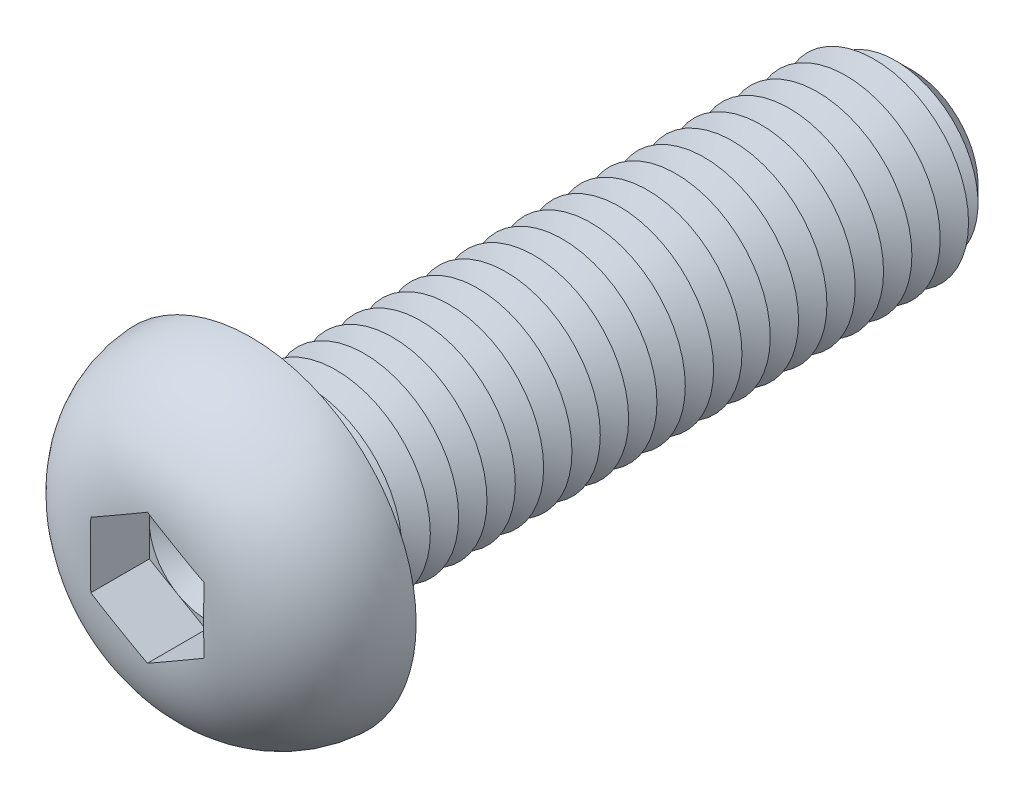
from build123d import *

# Parameters (mm, degrees)
CUT_EXTRUDE1_DEPTH  = 3.12
SKETCH4_R           = 5
BOSS_EXTRUDE1_DEPTH = 35
CHAMFER1_SIZE       = 1.5
LPATTERN1_COUNT     = 22
LPATTERN1_PITCH     = 1.5
FILLET2_R           = 0.6


with BuildPart() as part:
    # Sketch2 → Revolve1 (revolve)
    with BuildSketch(Plane(origin=(0, 0, 0), x_dir=(0, 0, -1), z_dir=(1, 0, 0)), mode=Mode.PRIVATE) as revolve1_sk:
        with BuildLine():
            Line((0, 0), (-5.5, 0))
            Line((-5.5, 0), (-5.5, 2.957763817))
            ThreePointArc((-5.5, 2.957763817), (-3.905948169, 6.951508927), (0, 8.75))
            Line((0, 8.75), (0, 0))
        make_face()
    revolve(revolve1_sk.sketch.rotate(Axis((0, 0, 47.934239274), (0, 0, -1)), 90), axis=Axis((0, 0, 47.934239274), (0, 0, -1)))

    # Sketch3 → Cut-Extrude1 (cut)
    with BuildSketch(Plane.XY.offset(5.5)):
        Polygon((0, 3.464101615), (-3, 1.732050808), (-3, -1.732050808), (0, -3.464101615), (3, -1.732050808), (3, 1.732050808), align=None)
    extrude(amount=-CUT_EXTRUDE1_DEPTH, mode=Mode.SUBTRACT)

    # Sketch4 → Boss-Extrude1 (add)
    with BuildSketch(Plane(origin=(0, 0, 0), x_dir=(-1, 0, 0), z_dir=(0, 0, -1))):
        with Locations(Location((0, 0, 0), (0, 0, 180))):
            Circle(SKETCH4_R)
    extrude(amount=BOSS_EXTRUDE1_DEPTH)

    # Chamfer1
    chamfer1_edges = [part.edges().sort_by_distance(p)[0] for p in [
        (-5, 0, -35),
    ]]
    chamfer(chamfer1_edges, length=CHAMFER1_SIZE)

    # Sketch5 → Cut-Revolve1 (revolve, cut)
    with BuildSketch(Plane(origin=(0, 0, 0), x_dir=(0, 0, -1), z_dir=(1, 0, 0)), mode=Mode.PRIVATE) as cut_revolve1_sk:
        Polygon((1.5, 5), (3, 5), (2.25, 3.700961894), align=None)
    cut_revolve1 = revolve(cut_revolve1_sk.sketch.rotate(Axis((0, 0, 47.934239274), (0, 0, -1)), 90), axis=Axis((0, 0, 47.934239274), (0, 0, -1)), mode=Mode.SUBTRACT)

    # LPattern1: Cut-Revolve1 ×22
    with Locations(*[(0, 0, -i * LPATTERN1_PITCH) for i in range(1, LPATTERN1_COUNT)]):
        add(cut_revolve1, mode=Mode.SUBTRACT)

    # Fillet2
    fillet2_edges = [part.edges().sort_by_distance(p)[0] for p in [
        (-5, 0, 0),
    ]]
    fillet(fillet2_edges, radius=FILLET2_R)

    # Cut-Extrude2 cone 1 section (on through the dimple's axis) → Cut-Extrude2 (revolve, cut)
    with BuildSketch(Plane(origin=(0, 0, 2.38), x_dir=(0, -1, 0), z_dir=(1, 0, 0))):
        Polygon((0, 0), (3, 0), (0, 1.732050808), align=None)
    revolve(axis=Axis((0, 0, 2.38), (0, 0, -1)), mode=Mode.SUBTRACT)


solid = part.part
